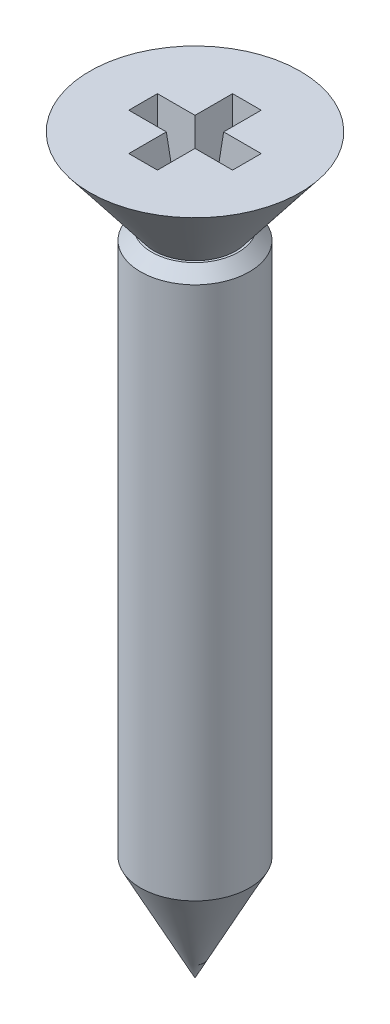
ISO-10303-21;
HEADER;
FILE_DESCRIPTION(('STEP AP214'),'2;1');
FILE_NAME('part.step','',(''),(''),'','','');
FILE_SCHEMA(('AUTOMOTIVE_DESIGN { 1 0 10303 214 1 1 1 1 }'));
ENDSEC;
DATA;
#1=APPLICATION_CONTEXT('core data for automotive mechanical design processes');
#2=APPLICATION_PROTOCOL_DEFINITION('international standard','automotive_design',2000,#1);
#3=PRODUCT_CONTEXT('',#1,'mechanical');
#4=PRODUCT('Part','Part','',(#3));
#5=PRODUCT_RELATED_PRODUCT_CATEGORY('part','',(#4));
#6=PRODUCT_DEFINITION_FORMATION('','',#4);
#7=PRODUCT_DEFINITION_CONTEXT('part definition',#1,'design');
#8=PRODUCT_DEFINITION('design','',#6,#7);
#9=PRODUCT_DEFINITION_SHAPE('','',#8);
#10=(LENGTH_UNIT() NAMED_UNIT(*) SI_UNIT(.MILLI.,.METRE.));
#11=(NAMED_UNIT(*) PLANE_ANGLE_UNIT() SI_UNIT($,.RADIAN.));
#12=(NAMED_UNIT(*) SI_UNIT($,.STERADIAN.) SOLID_ANGLE_UNIT());
#13=UNCERTAINTY_MEASURE_WITH_UNIT(LENGTH_MEASURE(1.E-05),#10,'distance_accuracy_value','');
#14=(GEOMETRIC_REPRESENTATION_CONTEXT(3) GLOBAL_UNCERTAINTY_ASSIGNED_CONTEXT((#13)) GLOBAL_UNIT_ASSIGNED_CONTEXT((#10,
#11,#12)) REPRESENTATION_CONTEXT('',''));
#15=CARTESIAN_POINT('',(0.,0.,0.));
#16=DIRECTION('',(0.,0.,1.));
#17=DIRECTION('',(1.,0.,0.));
#18=AXIS2_PLACEMENT_3D('',#15,#16,#17);
#19=CARTESIAN_POINT('',(0.,-22.9482396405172,0.));
#20=DIRECTION('',(0.,1.,0.));
#21=DIRECTION('',(0.,0.,1.));
#22=AXIS2_PLACEMENT_3D('',#19,#20,#21);
#23=CONICAL_SURFACE('',#22,0.,0.477831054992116);
#24=CARTESIAN_POINT('',(0.,-20.1482396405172,0.));
#25=DIRECTION('',(0.,1.,0.));
#26=DIRECTION('',(0.,0.,1.));
#27=AXIS2_PLACEMENT_3D('',#24,#25,#26);
#28=CIRCLE('',#27,1.45);
#29=CARTESIAN_POINT('',(0.,-20.1482396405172,1.45));
#30=VERTEX_POINT('',#29);
#31=EDGE_CURVE('E192',#30,#30,#28,.T.);
#32=ORIENTED_EDGE('',*,*,#31,.F.);
#33=EDGE_LOOP('',(#32));
#34=FACE_BOUND('',#33,.T.);
#35=CARTESIAN_POINT('',(0.,-22.9482396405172,0.));
#36=VERTEX_POINT('',#35);
#37=VERTEX_LOOP('',#36);
#38=FACE_BOUND('',#37,.T.);
#39=ADVANCED_FACE('F26',(#34,#38),#23,.T.);
#40=CARTESIAN_POINT('',(0.,0.,0.));
#41=DIRECTION('',(0.,1.,0.));
#42=DIRECTION('',(0.,0.,1.));
#43=AXIS2_PLACEMENT_3D('',#40,#41,#42);
#44=CYLINDRICAL_SURFACE('',#43,1.45);
#45=CARTESIAN_POINT('',(0.,-5.94823964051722,0.));
#46=DIRECTION('',(0.,-1.,0.));
#47=DIRECTION('',(0.,0.,-1.));
#48=AXIS2_PLACEMENT_3D('',#45,#46,#47);
#49=CIRCLE('',#48,1.45);
#50=CARTESIAN_POINT('',(0.,-5.94823964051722,-1.45));
#51=VERTEX_POINT('',#50);
#52=EDGE_CURVE('E11',#51,#51,#49,.T.);
#53=ORIENTED_EDGE('',*,*,#52,.T.);
#54=EDGE_LOOP('',(#53));
#55=FACE_BOUND('',#54,.T.);
#56=ORIENTED_EDGE('',*,*,#31,.T.);
#57=EDGE_LOOP('',(#56));
#58=FACE_BOUND('',#57,.T.);
#59=ADVANCED_FACE('F276',(#55,#58),#44,.T.);
#60=CARTESIAN_POINT('',(1.09,-5.64823964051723,0.));
#61=DIRECTION('',(0.,-1.,0.));
#62=DIRECTION('',(0.,0.,-1.));
#63=AXIS2_PLACEMENT_3D('',#60,#61,#62);
#64=PLANE('',#63);
#65=CARTESIAN_POINT('',(0.,-5.64823964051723,0.));
#66=DIRECTION('',(0.,-1.,0.));
#67=DIRECTION('',(0.,0.,-1.));
#68=AXIS2_PLACEMENT_3D('',#65,#66,#67);
#69=CIRCLE('',#68,1.15000000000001);
#70=CARTESIAN_POINT('',(0.,-5.64823964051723,-1.15000000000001));
#71=VERTEX_POINT('',#70);
#72=EDGE_CURVE('E36',#71,#71,#69,.F.);
#73=ORIENTED_EDGE('',*,*,#72,.T.);
#74=EDGE_LOOP('',(#73));
#75=FACE_BOUND('',#74,.T.);
#76=CARTESIAN_POINT('',(0.,-5.64823964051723,0.));
#77=DIRECTION('',(0.,1.,0.));
#78=DIRECTION('',(0.,0.,1.));
#79=AXIS2_PLACEMENT_3D('',#76,#77,#78);
#80=CIRCLE('',#79,1.09);
#81=CARTESIAN_POINT('',(0.,-5.64823964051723,1.09));
#82=VERTEX_POINT('',#81);
#83=EDGE_CURVE('E195',#82,#82,#80,.T.);
#84=ORIENTED_EDGE('',*,*,#83,.F.);
#85=EDGE_LOOP('',(#84));
#86=FACE_BOUND('',#85,.T.);
#87=ADVANCED_FACE('F283',(#75,#86),#64,.F.);
#88=CARTESIAN_POINT('',(0.,-5.64823964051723,0.));
#89=DIRECTION('',(0.,1.,0.));
#90=DIRECTION('',(0.,0.,1.));
#91=AXIS2_PLACEMENT_3D('',#88,#89,#90);
#92=CONICAL_SURFACE('',#91,1.09,0.66072840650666);
#93=CARTESIAN_POINT('',(0.,-3.44823964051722,0.));
#94=DIRECTION('',(0.,1.,0.));
#95=DIRECTION('',(0.,0.,1.));
#96=AXIS2_PLACEMENT_3D('',#93,#94,#95);
#97=CIRCLE('',#96,2.8);
#98=CARTESIAN_POINT('',(0.,-3.44823964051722,2.8));
#99=VERTEX_POINT('',#98);
#100=EDGE_CURVE('E182',#99,#99,#97,.T.);
#101=ORIENTED_EDGE('',*,*,#100,.F.);
#102=EDGE_LOOP('',(#101));
#103=FACE_BOUND('',#102,.T.);
#104=ORIENTED_EDGE('',*,*,#83,.T.);
#105=EDGE_LOOP('',(#104));
#106=FACE_BOUND('',#105,.T.);
#107=ADVANCED_FACE('F347',(#103,#106),#92,.T.);
#108=CARTESIAN_POINT('',(0.,-3.44823964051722,0.));
#109=DIRECTION('',(0.,-1.,0.));
#110=DIRECTION('',(0.,0.,-1.));
#111=AXIS2_PLACEMENT_3D('',#108,#109,#110);
#112=PLANE('',#111);
#113=DIRECTION('',(1.,0.,0.));
#114=VECTOR('',#113,1.);
#115=CARTESIAN_POINT('',(-1.25,-3.44823964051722,-0.381232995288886));
#116=LINE('',#115,#114);
#117=CARTESIAN_POINT('',(-0.381232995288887,-3.44823964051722,-0.381232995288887));
#118=VERTEX_POINT('',#117);
#119=CARTESIAN_POINT('',(-1.38123299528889,-3.44823964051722,-0.381232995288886));
#120=VERTEX_POINT('',#119);
#121=EDGE_CURVE('E121',#118,#120,#116,.F.);
#122=ORIENTED_EDGE('',*,*,#121,.F.);
#123=DIRECTION('',(0.,0.,-1.));
#124=VECTOR('',#123,1.);
#125=CARTESIAN_POINT('',(-0.381232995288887,-3.44823964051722,-0.250000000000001));
#126=LINE('',#125,#124);
#127=CARTESIAN_POINT('',(-0.381232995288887,-3.44823964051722,-1.38123299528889));
#128=VERTEX_POINT('',#127);
#129=EDGE_CURVE('E45',#128,#118,#126,.F.);
#130=ORIENTED_EDGE('',*,*,#129,.F.);
#131=DIRECTION('',(1.,0.,0.));
#132=VECTOR('',#131,1.);
#133=CARTESIAN_POINT('',(-0.250000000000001,-3.44823964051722,-1.38123299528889));
#134=LINE('',#133,#132);
#135=CARTESIAN_POINT('',(0.381232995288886,-3.44823964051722,-1.38123299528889));
#136=VERTEX_POINT('',#135);
#137=EDGE_CURVE('E134',#136,#128,#134,.F.);
#138=ORIENTED_EDGE('',*,*,#137,.F.);
#139=DIRECTION('',(0.,0.,1.));
#140=VECTOR('',#139,1.);
#141=CARTESIAN_POINT('',(0.381232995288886,-3.44823964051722,-1.25));
#142=LINE('',#141,#140);
#143=CARTESIAN_POINT('',(0.381232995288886,-3.44823964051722,-0.381232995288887));
#144=VERTEX_POINT('',#143);
#145=EDGE_CURVE('E138',#144,#136,#142,.F.);
#146=ORIENTED_EDGE('',*,*,#145,.F.);
#147=DIRECTION('',(1.,0.,0.));
#148=VECTOR('',#147,1.);
#149=CARTESIAN_POINT('',(0.249999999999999,-3.44823964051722,-0.381232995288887));
#150=LINE('',#149,#148);
#151=CARTESIAN_POINT('',(1.38123299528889,-3.44823964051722,-0.381232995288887));
#152=VERTEX_POINT('',#151);
#153=EDGE_CURVE('E141',#152,#144,#150,.F.);
#154=ORIENTED_EDGE('',*,*,#153,.F.);
#155=DIRECTION('',(0.,0.,1.));
#156=VECTOR('',#155,1.);
#157=CARTESIAN_POINT('',(1.38123299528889,-3.44823964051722,-0.250000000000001));
#158=LINE('',#157,#156);
#159=CARTESIAN_POINT('',(1.38123299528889,-3.44823964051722,0.381232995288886));
#160=VERTEX_POINT('',#159);
#161=EDGE_CURVE('E143',#160,#152,#158,.F.);
#162=ORIENTED_EDGE('',*,*,#161,.F.);
#163=DIRECTION('',(-1.,0.,0.));
#164=VECTOR('',#163,1.);
#165=CARTESIAN_POINT('',(1.25,-3.44823964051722,0.381232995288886));
#166=LINE('',#165,#164);
#167=CARTESIAN_POINT('',(0.381232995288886,-3.44823964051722,0.381232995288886));
#168=VERTEX_POINT('',#167);
#169=EDGE_CURVE('E30',#168,#160,#166,.F.);
#170=ORIENTED_EDGE('',*,*,#169,.F.);
#171=DIRECTION('',(0.,0.,1.));
#172=VECTOR('',#171,1.);
#173=CARTESIAN_POINT('',(0.381232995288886,-3.44823964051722,0.25));
#174=LINE('',#173,#172);
#175=CARTESIAN_POINT('',(0.381232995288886,-3.44823964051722,1.38123299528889));
#176=VERTEX_POINT('',#175);
#177=EDGE_CURVE('E147',#176,#168,#174,.F.);
#178=ORIENTED_EDGE('',*,*,#177,.F.);
#179=DIRECTION('',(-1.,0.,0.));
#180=VECTOR('',#179,1.);
#181=CARTESIAN_POINT('',(0.25,-3.44823964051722,1.38123299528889));
#182=LINE('',#181,#180);
#183=CARTESIAN_POINT('',(-0.381232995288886,-3.44823964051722,1.38123299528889));
#184=VERTEX_POINT('',#183);
#185=EDGE_CURVE('E149',#184,#176,#182,.F.);
#186=ORIENTED_EDGE('',*,*,#185,.F.);
#187=DIRECTION('',(0.,0.,-1.));
#188=VECTOR('',#187,1.);
#189=CARTESIAN_POINT('',(-0.381232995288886,-3.44823964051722,1.25));
#190=LINE('',#189,#188);
#191=CARTESIAN_POINT('',(-0.381232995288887,-3.44823964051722,0.381232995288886));
#192=VERTEX_POINT('',#191);
#193=EDGE_CURVE('E129',#192,#184,#190,.F.);
#194=ORIENTED_EDGE('',*,*,#193,.F.);
#195=DIRECTION('',(-1.,0.,0.));
#196=VECTOR('',#195,1.);
#197=CARTESIAN_POINT('',(-0.25,-3.44823964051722,0.381232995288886));
#198=LINE('',#197,#196);
#199=CARTESIAN_POINT('',(-1.38123299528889,-3.44823964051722,0.381232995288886));
#200=VERTEX_POINT('',#199);
#201=EDGE_CURVE('E127',#200,#192,#198,.F.);
#202=ORIENTED_EDGE('',*,*,#201,.F.);
#203=DIRECTION('',(0.,0.,-1.));
#204=VECTOR('',#203,1.);
#205=CARTESIAN_POINT('',(-1.38123299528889,-3.44823964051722,0.25));
#206=LINE('',#205,#204);
#207=EDGE_CURVE('E110',#120,#200,#206,.F.);
#208=ORIENTED_EDGE('',*,*,#207,.F.);
#209=EDGE_LOOP('',(#122,#130,#138,#146,#154,#162,#170,#178,#186,#194,#202,#208));
#210=FACE_BOUND('',#209,.T.);
#211=ORIENTED_EDGE('',*,*,#100,.T.);
#212=EDGE_LOOP('',(#211));
#213=FACE_BOUND('',#212,.T.);
#214=ADVANCED_FACE('F124',(#210,#213),#112,.F.);
#215=CARTESIAN_POINT('',(0.,-5.64823964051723,0.));
#216=DIRECTION('',(0.,-1.,0.));
#217=DIRECTION('',(0.,0.,-1.));
#218=AXIS2_PLACEMENT_3D('',#215,#216,#217);
#219=CONICAL_SURFACE('',#218,1.15000000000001,0.785398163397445);
#220=ORIENTED_EDGE('',*,*,#52,.F.);
#221=EDGE_LOOP('',(#220));
#222=FACE_BOUND('',#221,.T.);
#223=ORIENTED_EDGE('',*,*,#72,.F.);
#224=EDGE_LOOP('',(#223));
#225=FACE_BOUND('',#224,.T.);
#226=ADVANCED_FACE('F272',(#222,#225),#219,.T.);
#227=CARTESIAN_POINT('',(-0.25,-4.94823964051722,-0.250000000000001));
#228=DIRECTION('',(0.996194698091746,0.0871557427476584,0.));
#229=DIRECTION('',(-0.0871557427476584,0.996194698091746,0.));
#230=AXIS2_PLACEMENT_3D('',#227,#228,#229);
#231=PLANE('',#230);
#232=ORIENTED_EDGE('',*,*,#129,.T.);
#233=DIRECTION('',(-0.0868265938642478,0.992432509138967,-0.0868265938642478));
#234=VECTOR('',#233,1.);
#235=CARTESIAN_POINT('',(-0.257538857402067,-4.86207010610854,-0.257538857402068));
#236=LINE('',#235,#234);
#237=CARTESIAN_POINT('',(-0.25,-4.94823964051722,-0.250000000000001));
#238=VERTEX_POINT('',#237);
#239=EDGE_CURVE('E118',#238,#118,#236,.T.);
#240=ORIENTED_EDGE('',*,*,#239,.F.);
#241=DIRECTION('',(0.,0.,1.));
#242=VECTOR('',#241,1.);
#243=CARTESIAN_POINT('',(-0.25,-4.94823964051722,-0.250000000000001));
#244=LINE('',#243,#242);
#245=CARTESIAN_POINT('',(-0.250000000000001,-4.94823964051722,-1.25));
#246=VERTEX_POINT('',#245);
#247=EDGE_CURVE('E137',#246,#238,#244,.T.);
#248=ORIENTED_EDGE('',*,*,#247,.F.);
#249=DIRECTION('',(-0.0868265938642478,0.992432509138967,-0.0868265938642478));
#250=VECTOR('',#249,1.);
#251=CARTESIAN_POINT('',(-0.250000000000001,-4.94823964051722,-1.25));
#252=LINE('',#251,#250);
#253=EDGE_CURVE('E180',#246,#128,#252,.T.);
#254=ORIENTED_EDGE('',*,*,#253,.T.);
#255=EDGE_LOOP('',(#232,#240,#248,#254));
#256=FACE_BOUND('',#255,.T.);
#257=ADVANCED_FACE('F232',(#256),#231,.T.);
#258=CARTESIAN_POINT('',(-0.250000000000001,-4.94823964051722,-1.25));
#259=DIRECTION('',(0.,0.0871557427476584,0.996194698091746));
#260=DIRECTION('',(0.,-0.996194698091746,0.0871557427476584));
#261=AXIS2_PLACEMENT_3D('',#258,#259,#260);
#262=PLANE('',#261);
#263=ORIENTED_EDGE('',*,*,#137,.T.);
#264=ORIENTED_EDGE('',*,*,#253,.F.);
#265=DIRECTION('',(-1.,0.,0.));
#266=VECTOR('',#265,1.);
#267=CARTESIAN_POINT('',(-0.250000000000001,-4.94823964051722,-1.25));
#268=LINE('',#267,#266);
#269=CARTESIAN_POINT('',(0.249999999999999,-4.94823964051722,-1.25));
#270=VERTEX_POINT('',#269);
#271=EDGE_CURVE('E179',#270,#246,#268,.T.);
#272=ORIENTED_EDGE('',*,*,#271,.F.);
#273=DIRECTION('',(0.0868265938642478,0.992432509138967,-0.0868265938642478));
#274=VECTOR('',#273,1.);
#275=CARTESIAN_POINT('',(0.249999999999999,-4.94823964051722,-1.25));
#276=LINE('',#275,#274);
#277=EDGE_CURVE('E183',#270,#136,#276,.T.);
#278=ORIENTED_EDGE('',*,*,#277,.T.);
#279=EDGE_LOOP('',(#263,#264,#272,#278));
#280=FACE_BOUND('',#279,.T.);
#281=ADVANCED_FACE('F264',(#280),#262,.T.);
#282=CARTESIAN_POINT('',(0.249999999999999,-4.94823964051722,-1.25));
#283=DIRECTION('',(-0.996194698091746,0.0871557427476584,0.));
#284=DIRECTION('',(-0.0871557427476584,-0.996194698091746,0.));
#285=AXIS2_PLACEMENT_3D('',#282,#283,#284);
#286=PLANE('',#285);
#287=ORIENTED_EDGE('',*,*,#145,.T.);
#288=ORIENTED_EDGE('',*,*,#277,.F.);
#289=DIRECTION('',(0.,0.,-1.));
#290=VECTOR('',#289,1.);
#291=CARTESIAN_POINT('',(0.249999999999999,-4.94823964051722,-1.25));
#292=LINE('',#291,#290);
#293=CARTESIAN_POINT('',(0.249999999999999,-4.94823964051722,-0.250000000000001));
#294=VERTEX_POINT('',#293);
#295=EDGE_CURVE('E202',#294,#270,#292,.T.);
#296=ORIENTED_EDGE('',*,*,#295,.F.);
#297=DIRECTION('',(0.0868265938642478,0.992432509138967,-0.0868265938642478));
#298=VECTOR('',#297,1.);
#299=CARTESIAN_POINT('',(0.257538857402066,-4.86207010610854,-0.257538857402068));
#300=LINE('',#299,#298);
#301=EDGE_CURVE('E185',#294,#144,#300,.T.);
#302=ORIENTED_EDGE('',*,*,#301,.T.);
#303=EDGE_LOOP('',(#287,#288,#296,#302));
#304=FACE_BOUND('',#303,.T.);
#305=ADVANCED_FACE('F262',(#304),#286,.T.);
#306=CARTESIAN_POINT('',(0.249999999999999,-4.94823964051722,-0.250000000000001));
#307=DIRECTION('',(0.,0.0871557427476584,0.996194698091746));
#308=DIRECTION('',(0.,-0.996194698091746,0.0871557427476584));
#309=AXIS2_PLACEMENT_3D('',#306,#307,#308);
#310=PLANE('',#309);
#311=ORIENTED_EDGE('',*,*,#153,.T.);
#312=ORIENTED_EDGE('',*,*,#301,.F.);
#313=DIRECTION('',(-1.,0.,0.));
#314=VECTOR('',#313,1.);
#315=CARTESIAN_POINT('',(0.249999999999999,-4.94823964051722,-0.250000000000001));
#316=LINE('',#315,#314);
#317=CARTESIAN_POINT('',(1.25,-4.94823964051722,-0.250000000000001));
#318=VERTEX_POINT('',#317);
#319=EDGE_CURVE('E205',#318,#294,#316,.T.);
#320=ORIENTED_EDGE('',*,*,#319,.F.);
#321=DIRECTION('',(0.0868265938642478,0.992432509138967,-0.0868265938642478));
#322=VECTOR('',#321,1.);
#323=CARTESIAN_POINT('',(1.25,-4.94823964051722,-0.250000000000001));
#324=LINE('',#323,#322);
#325=EDGE_CURVE('E186',#318,#152,#324,.T.);
#326=ORIENTED_EDGE('',*,*,#325,.T.);
#327=EDGE_LOOP('',(#311,#312,#320,#326));
#328=FACE_BOUND('',#327,.T.);
#329=ADVANCED_FACE('F259',(#328),#310,.T.);
#330=CARTESIAN_POINT('',(1.25,-4.94823964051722,-0.250000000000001));
#331=DIRECTION('',(-0.996194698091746,0.0871557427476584,0.));
#332=DIRECTION('',(-0.0871557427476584,-0.996194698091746,0.));
#333=AXIS2_PLACEMENT_3D('',#330,#331,#332);
#334=PLANE('',#333);
#335=ORIENTED_EDGE('',*,*,#161,.T.);
#336=ORIENTED_EDGE('',*,*,#325,.F.);
#337=DIRECTION('',(0.,0.,-1.));
#338=VECTOR('',#337,1.);
#339=CARTESIAN_POINT('',(1.25,-4.94823964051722,-0.250000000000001));
#340=LINE('',#339,#338);
#341=CARTESIAN_POINT('',(1.25,-4.94823964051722,0.249999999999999));
#342=VERTEX_POINT('',#341);
#343=EDGE_CURVE('E208',#342,#318,#340,.T.);
#344=ORIENTED_EDGE('',*,*,#343,.F.);
#345=DIRECTION('',(0.0868265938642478,0.992432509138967,0.0868265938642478));
#346=VECTOR('',#345,1.);
#347=CARTESIAN_POINT('',(1.25,-4.94823964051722,0.249999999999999));
#348=LINE('',#347,#346);
#349=EDGE_CURVE('E71',#342,#160,#348,.T.);
#350=ORIENTED_EDGE('',*,*,#349,.T.);
#351=EDGE_LOOP('',(#335,#336,#344,#350));
#352=FACE_BOUND('',#351,.T.);
#353=ADVANCED_FACE('F257',(#352),#334,.T.);
#354=CARTESIAN_POINT('',(1.25,-4.94823964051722,0.249999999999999));
#355=DIRECTION('',(0.,0.0871557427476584,-0.996194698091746));
#356=DIRECTION('',(0.,0.996194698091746,0.0871557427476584));
#357=AXIS2_PLACEMENT_3D('',#354,#355,#356);
#358=PLANE('',#357);
#359=ORIENTED_EDGE('',*,*,#169,.T.);
#360=ORIENTED_EDGE('',*,*,#349,.F.);
#361=DIRECTION('',(1.,0.,0.));
#362=VECTOR('',#361,1.);
#363=CARTESIAN_POINT('',(1.25,-4.94823964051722,0.249999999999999));
#364=LINE('',#363,#362);
#365=CARTESIAN_POINT('',(0.25,-4.94823964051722,0.25));
#366=VERTEX_POINT('',#365);
#367=EDGE_CURVE('E211',#366,#342,#364,.T.);
#368=ORIENTED_EDGE('',*,*,#367,.F.);
#369=DIRECTION('',(0.0868265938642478,0.992432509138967,0.0868265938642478));
#370=VECTOR('',#369,1.);
#371=CARTESIAN_POINT('',(0.257538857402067,-4.86207010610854,0.257538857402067));
#372=LINE('',#371,#370);
#373=EDGE_CURVE('E78',#366,#168,#372,.T.);
#374=ORIENTED_EDGE('',*,*,#373,.T.);
#375=EDGE_LOOP('',(#359,#360,#368,#374));
#376=FACE_BOUND('',#375,.T.);
#377=ADVANCED_FACE('F256',(#376),#358,.T.);
#378=CARTESIAN_POINT('',(0.25,-4.94823964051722,0.25));
#379=DIRECTION('',(-0.996194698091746,0.0871557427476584,0.));
#380=DIRECTION('',(-0.0871557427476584,-0.996194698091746,0.));
#381=AXIS2_PLACEMENT_3D('',#378,#379,#380);
#382=PLANE('',#381);
#383=ORIENTED_EDGE('',*,*,#177,.T.);
#384=ORIENTED_EDGE('',*,*,#373,.F.);
#385=DIRECTION('',(0.,0.,-1.));
#386=VECTOR('',#385,1.);
#387=CARTESIAN_POINT('',(0.25,-4.94823964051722,0.25));
#388=LINE('',#387,#386);
#389=CARTESIAN_POINT('',(0.25,-4.94823964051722,1.25));
#390=VERTEX_POINT('',#389);
#391=EDGE_CURVE('E214',#390,#366,#388,.T.);
#392=ORIENTED_EDGE('',*,*,#391,.F.);
#393=DIRECTION('',(0.0868265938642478,0.992432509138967,0.0868265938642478));
#394=VECTOR('',#393,1.);
#395=CARTESIAN_POINT('',(0.25,-4.94823964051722,1.25));
#396=LINE('',#395,#394);
#397=EDGE_CURVE('E86',#390,#176,#396,.T.);
#398=ORIENTED_EDGE('',*,*,#397,.T.);
#399=EDGE_LOOP('',(#383,#384,#392,#398));
#400=FACE_BOUND('',#399,.T.);
#401=ADVANCED_FACE('F255',(#400),#382,.T.);
#402=CARTESIAN_POINT('',(0.25,-4.94823964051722,1.25));
#403=DIRECTION('',(0.,0.0871557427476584,-0.996194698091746));
#404=DIRECTION('',(0.,0.996194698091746,0.0871557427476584));
#405=AXIS2_PLACEMENT_3D('',#402,#403,#404);
#406=PLANE('',#405);
#407=ORIENTED_EDGE('',*,*,#185,.T.);
#408=ORIENTED_EDGE('',*,*,#397,.F.);
#409=DIRECTION('',(1.,0.,0.));
#410=VECTOR('',#409,1.);
#411=CARTESIAN_POINT('',(0.25,-4.94823964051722,1.25));
#412=LINE('',#411,#410);
#413=CARTESIAN_POINT('',(-0.25,-4.94823964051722,1.25));
#414=VERTEX_POINT('',#413);
#415=EDGE_CURVE('E170',#414,#390,#412,.T.);
#416=ORIENTED_EDGE('',*,*,#415,.F.);
#417=DIRECTION('',(-0.0868265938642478,0.992432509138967,0.0868265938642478));
#418=VECTOR('',#417,1.);
#419=CARTESIAN_POINT('',(-0.25,-4.94823964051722,1.25));
#420=LINE('',#419,#418);
#421=EDGE_CURVE('E162',#414,#184,#420,.T.);
#422=ORIENTED_EDGE('',*,*,#421,.T.);
#423=EDGE_LOOP('',(#407,#408,#416,#422));
#424=FACE_BOUND('',#423,.T.);
#425=ADVANCED_FACE('F167',(#424),#406,.T.);
#426=CARTESIAN_POINT('',(-0.25,-4.94823964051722,1.25));
#427=DIRECTION('',(0.996194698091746,0.0871557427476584,0.));
#428=DIRECTION('',(-0.0871557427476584,0.996194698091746,0.));
#429=AXIS2_PLACEMENT_3D('',#426,#427,#428);
#430=PLANE('',#429);
#431=ORIENTED_EDGE('',*,*,#193,.T.);
#432=ORIENTED_EDGE('',*,*,#421,.F.);
#433=DIRECTION('',(0.,0.,1.));
#434=VECTOR('',#433,1.);
#435=CARTESIAN_POINT('',(-0.25,-4.94823964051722,1.25));
#436=LINE('',#435,#434);
#437=CARTESIAN_POINT('',(-0.25,-4.94823964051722,0.25));
#438=VERTEX_POINT('',#437);
#439=EDGE_CURVE('E218',#438,#414,#436,.T.);
#440=ORIENTED_EDGE('',*,*,#439,.F.);
#441=DIRECTION('',(-0.0868265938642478,0.992432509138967,0.0868265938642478));
#442=VECTOR('',#441,1.);
#443=CARTESIAN_POINT('',(-0.257538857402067,-4.86207010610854,0.257538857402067));
#444=LINE('',#443,#442);
#445=EDGE_CURVE('E165',#438,#192,#444,.T.);
#446=ORIENTED_EDGE('',*,*,#445,.T.);
#447=EDGE_LOOP('',(#431,#432,#440,#446));
#448=FACE_BOUND('',#447,.T.);
#449=ADVANCED_FACE('F159',(#448),#430,.T.);
#450=CARTESIAN_POINT('',(-0.25,-4.94823964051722,0.25));
#451=DIRECTION('',(0.,0.0871557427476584,-0.996194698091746));
#452=DIRECTION('',(0.,0.996194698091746,0.0871557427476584));
#453=AXIS2_PLACEMENT_3D('',#450,#451,#452);
#454=PLANE('',#453);
#455=ORIENTED_EDGE('',*,*,#201,.T.);
#456=ORIENTED_EDGE('',*,*,#445,.F.);
#457=DIRECTION('',(1.,0.,0.));
#458=VECTOR('',#457,1.);
#459=CARTESIAN_POINT('',(-0.25,-4.94823964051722,0.25));
#460=LINE('',#459,#458);
#461=CARTESIAN_POINT('',(-1.25,-4.94823964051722,0.25));
#462=VERTEX_POINT('',#461);
#463=EDGE_CURVE('E220',#462,#438,#460,.T.);
#464=ORIENTED_EDGE('',*,*,#463,.F.);
#465=DIRECTION('',(-0.0868265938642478,0.992432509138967,0.0868265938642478));
#466=VECTOR('',#465,1.);
#467=CARTESIAN_POINT('',(-1.25,-4.94823964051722,0.25));
#468=LINE('',#467,#466);
#469=EDGE_CURVE('E100',#462,#200,#468,.T.);
#470=ORIENTED_EDGE('',*,*,#469,.T.);
#471=EDGE_LOOP('',(#455,#456,#464,#470));
#472=FACE_BOUND('',#471,.T.);
#473=ADVANCED_FACE('F254',(#472),#454,.T.);
#474=CARTESIAN_POINT('',(-1.25,-4.94823964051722,0.25));
#475=DIRECTION('',(0.996194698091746,0.0871557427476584,0.));
#476=DIRECTION('',(-0.0871557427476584,0.996194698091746,0.));
#477=AXIS2_PLACEMENT_3D('',#474,#475,#476);
#478=PLANE('',#477);
#479=ORIENTED_EDGE('',*,*,#207,.T.);
#480=ORIENTED_EDGE('',*,*,#469,.F.);
#481=DIRECTION('',(0.,0.,1.));
#482=VECTOR('',#481,1.);
#483=CARTESIAN_POINT('',(-1.25,-4.94823964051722,0.25));
#484=LINE('',#483,#482);
#485=CARTESIAN_POINT('',(-1.25,-4.94823964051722,-0.25));
#486=VERTEX_POINT('',#485);
#487=EDGE_CURVE('E114',#486,#462,#484,.T.);
#488=ORIENTED_EDGE('',*,*,#487,.F.);
#489=DIRECTION('',(-0.0868265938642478,0.992432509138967,-0.0868265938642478));
#490=VECTOR('',#489,1.);
#491=CARTESIAN_POINT('',(-1.25,-4.94823964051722,-0.25));
#492=LINE('',#491,#490);
#493=EDGE_CURVE('E106',#486,#120,#492,.T.);
#494=ORIENTED_EDGE('',*,*,#493,.T.);
#495=EDGE_LOOP('',(#479,#480,#488,#494));
#496=FACE_BOUND('',#495,.T.);
#497=ADVANCED_FACE('F108',(#496),#478,.T.);
#498=CARTESIAN_POINT('',(-1.25,-4.94823964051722,-0.25));
#499=DIRECTION('',(0.,0.0871557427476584,0.996194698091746));
#500=DIRECTION('',(0.,-0.996194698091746,0.0871557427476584));
#501=AXIS2_PLACEMENT_3D('',#498,#499,#500);
#502=PLANE('',#501);
#503=ORIENTED_EDGE('',*,*,#121,.T.);
#504=ORIENTED_EDGE('',*,*,#493,.F.);
#505=DIRECTION('',(-1.,0.,0.));
#506=VECTOR('',#505,1.);
#507=CARTESIAN_POINT('',(-1.25,-4.94823964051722,-0.25));
#508=LINE('',#507,#506);
#509=EDGE_CURVE('E224',#238,#486,#508,.T.);
#510=ORIENTED_EDGE('',*,*,#509,.F.);
#511=ORIENTED_EDGE('',*,*,#239,.T.);
#512=EDGE_LOOP('',(#503,#504,#510,#511));
#513=FACE_BOUND('',#512,.T.);
#514=ADVANCED_FACE('F28',(#513),#502,.T.);
#515=CARTESIAN_POINT('',(-0.25,-4.94823964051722,0.25));
#516=DIRECTION('',(0.,1.,0.));
#517=DIRECTION('',(0.,0.,1.));
#518=AXIS2_PLACEMENT_3D('',#515,#516,#517);
#519=PLANE('',#518);
#520=ORIENTED_EDGE('',*,*,#247,.T.);
#521=ORIENTED_EDGE('',*,*,#509,.T.);
#522=ORIENTED_EDGE('',*,*,#487,.T.);
#523=ORIENTED_EDGE('',*,*,#463,.T.);
#524=ORIENTED_EDGE('',*,*,#439,.T.);
#525=ORIENTED_EDGE('',*,*,#415,.T.);
#526=ORIENTED_EDGE('',*,*,#391,.T.);
#527=ORIENTED_EDGE('',*,*,#367,.T.);
#528=ORIENTED_EDGE('',*,*,#343,.T.);
#529=ORIENTED_EDGE('',*,*,#319,.T.);
#530=ORIENTED_EDGE('',*,*,#295,.T.);
#531=ORIENTED_EDGE('',*,*,#271,.T.);
#532=EDGE_LOOP('',(#520,#521,#522,#523,#524,#525,#526,#527,#528,#529,#530,#531));
#533=FACE_BOUND('',#532,.T.);
#534=ADVANCED_FACE('F229',(#533),#519,.T.);
#535=CLOSED_SHELL('',(#39,#59,#87,#107,#214,#226,#257,#281,#305,#329,#353,#377,#401,#425,#449,
#473,#497,#514,#534));
#536=MANIFOLD_SOLID_BREP('B2',#535);
#537=ADVANCED_BREP_SHAPE_REPRESENTATION('',(#18,#536),#14);
#538=SHAPE_DEFINITION_REPRESENTATION(#9,#537);
ENDSEC;
END-ISO-10303-21;
